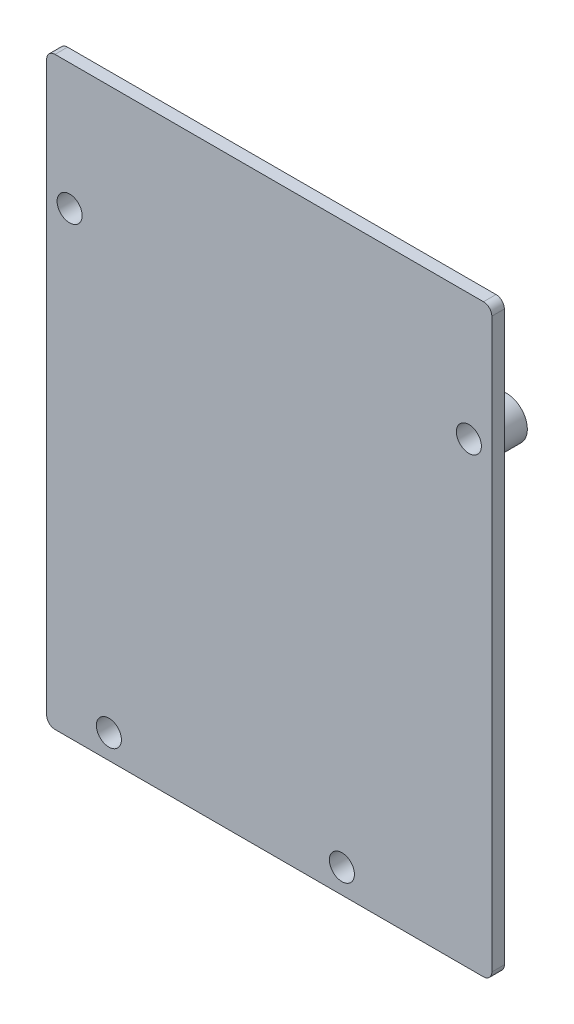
from build123d import *

# Parameters (mm, degrees)
ESQUISSE1_W             = 53.3
ESQUISSE1_H             = 70
BOSS_EXTRU_1_DEPTH      = 1.5
CONG_1_R                = 1
ESQUISSE2_R             = 2.5
BOSS_EXTRU_2_DEPTH      = 3
ESQUISSE3_R             = 1.5
ENL_V_MAT_EXTRU_1_DEPTH = 6
ESQUISSE4_R             = 1.5
ENL_V_MAT_EXTRU_2_DEPTH = 6
ESQUISSE5_R             = 1.5
ENL_V_MAT_EXTRU_3_DEPTH = 6
ESQUISSE6_R             = 1.5
ENL_V_MAT_EXTRU_4_DEPTH = 6


with BuildPart() as part:
    # Esquisse1 → Boss.-Extru.1 (new body)
    with BuildSketch(Plane.XY):
        Rectangle(ESQUISSE1_W, ESQUISSE1_H)
    extrude(amount=BOSS_EXTRU_1_DEPTH)

    # Cong_1
    cong_1_edges = [part.edges().sort_by_distance(p)[0] for p in [
        (-26.65, 35, 0.75),
        (26.65, 35, 0.75),
        (26.65, -35, 0.75),
        (-26.65, -35, 0.75),
    ]]
    fillet(cong_1_edges, radius=CONG_1_R)

    # Esquisse2 → Boss.-Extru.2 (add)
    with BuildSketch(Plane(origin=(0, 0, 0), x_dir=(-1, 0, 0), z_dir=(0, 0, -1))):
        with Locations(Location((-23.9, 19.9, 0), (0, 0, 180))):
            Circle(ESQUISSE2_R)
        with Locations(Location((23.9, 19.9, 0), (0, 0, 180))):
            Circle(ESQUISSE2_R)
        with Locations(Location((-8.7, -32.1, 0), (0, 0, 180))):
            Circle(ESQUISSE2_R)
        with Locations(Location((19.2, -32.1, 0), (0, 0, 180))):
            Circle(ESQUISSE2_R)
    extrude(amount=BOSS_EXTRU_2_DEPTH)

    # Esquisse3 → Enl_v. mat.-Extru.1 (cut)
    with BuildSketch(Plane(origin=(0, 0, -3), x_dir=(-1, 0, 0), z_dir=(0, 0, -1))):
        with Locations((-23.9, 19.9)):
            Circle(ESQUISSE3_R)
    extrude(amount=-ENL_V_MAT_EXTRU_1_DEPTH, mode=Mode.SUBTRACT)

    # Esquisse4 → Enl_v. mat.-Extru.2 (cut)
    with BuildSketch(Plane(origin=(0, 0, -3), x_dir=(-1, 0, 0), z_dir=(0, 0, -1))):
        with Locations((23.9, 19.9)):
            Circle(ESQUISSE4_R)
    extrude(amount=-ENL_V_MAT_EXTRU_2_DEPTH, mode=Mode.SUBTRACT)

    # Esquisse5 → Enl_v. mat.-Extru.3 (cut)
    with BuildSketch(Plane(origin=(0, 0, -3), x_dir=(-1, 0, 0), z_dir=(0, 0, -1))):
        with Locations((-8.7, -32.1)):
            Circle(ESQUISSE5_R)
    extrude(amount=-ENL_V_MAT_EXTRU_3_DEPTH, mode=Mode.SUBTRACT)

    # Esquisse6 → Enl_v. mat.-Extru.4 (cut)
    with BuildSketch(Plane(origin=(0, 0, -3), x_dir=(-1, 0, 0), z_dir=(0, 0, -1))):
        with Locations((19.2, -32.1)):
            Circle(ESQUISSE6_R)
    extrude(amount=-ENL_V_MAT_EXTRU_4_DEPTH, mode=Mode.SUBTRACT)


solid = part.part
